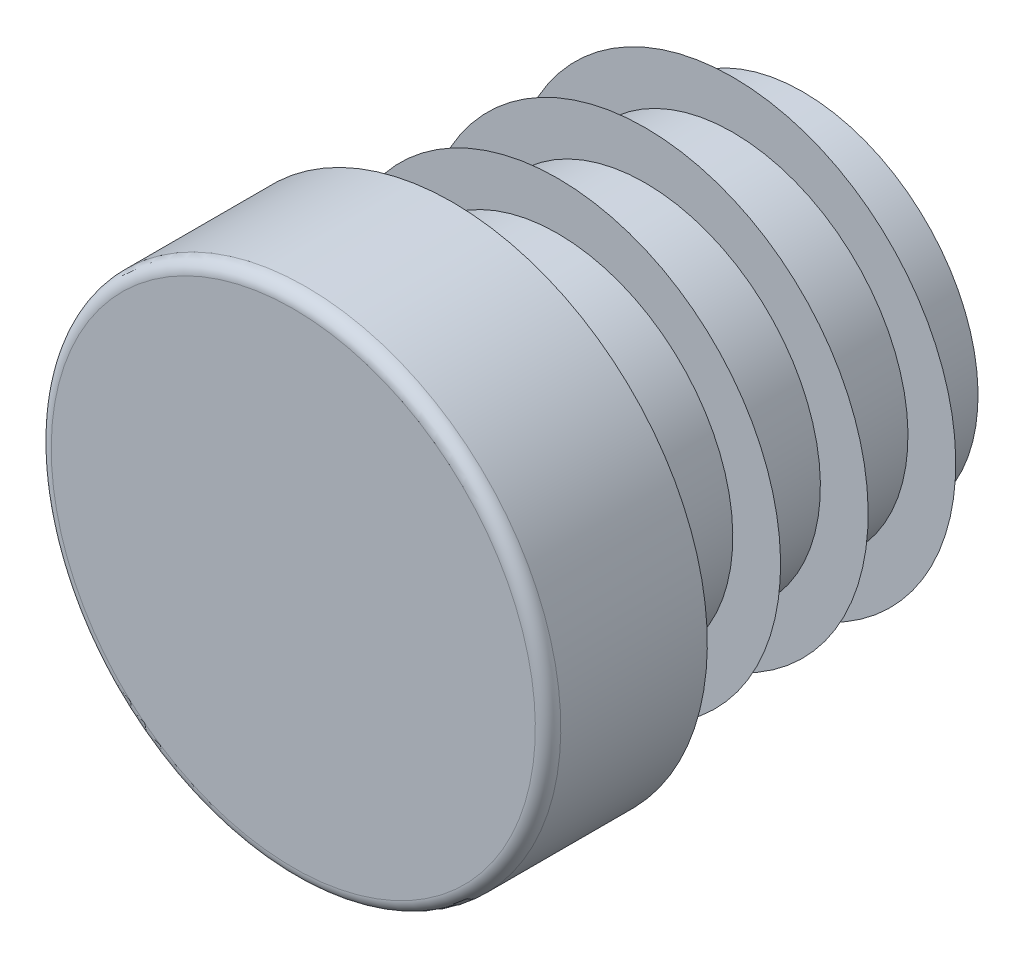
ISO-10303-21;
HEADER;
FILE_DESCRIPTION(('STEP AP214'),'2;1');
FILE_NAME('part.step','',(''),(''),'','','');
FILE_SCHEMA(('AUTOMOTIVE_DESIGN { 1 0 10303 214 1 1 1 1 }'));
ENDSEC;
DATA;
#1=APPLICATION_CONTEXT('core data for automotive mechanical design processes');
#2=APPLICATION_PROTOCOL_DEFINITION('international standard','automotive_design',2000,#1);
#3=PRODUCT_CONTEXT('',#1,'mechanical');
#4=PRODUCT('Part','Part','',(#3));
#5=PRODUCT_RELATED_PRODUCT_CATEGORY('part','',(#4));
#6=PRODUCT_DEFINITION_FORMATION('','',#4);
#7=PRODUCT_DEFINITION_CONTEXT('part definition',#1,'design');
#8=PRODUCT_DEFINITION('design','',#6,#7);
#9=PRODUCT_DEFINITION_SHAPE('','',#8);
#10=(LENGTH_UNIT() NAMED_UNIT(*) SI_UNIT(.MILLI.,.METRE.));
#11=(NAMED_UNIT(*) PLANE_ANGLE_UNIT() SI_UNIT($,.RADIAN.));
#12=(NAMED_UNIT(*) SI_UNIT($,.STERADIAN.) SOLID_ANGLE_UNIT());
#13=UNCERTAINTY_MEASURE_WITH_UNIT(LENGTH_MEASURE(1.E-05),#10,'distance_accuracy_value','');
#14=(GEOMETRIC_REPRESENTATION_CONTEXT(3) GLOBAL_UNCERTAINTY_ASSIGNED_CONTEXT((#13)) GLOBAL_UNIT_ASSIGNED_CONTEXT((#10,
#11,#12)) REPRESENTATION_CONTEXT('',''));
#15=CARTESIAN_POINT('',(0.,0.,0.));
#16=DIRECTION('',(0.,0.,1.));
#17=DIRECTION('',(1.,0.,0.));
#18=AXIS2_PLACEMENT_3D('',#15,#16,#17);
#19=CARTESIAN_POINT('',(0.,0.,5.));
#20=DIRECTION('',(0.,0.,-1.));
#21=DIRECTION('',(0.,1.,0.));
#22=AXIS2_PLACEMENT_3D('',#19,#20,#21);
#23=PLANE('',#22);
#24=CARTESIAN_POINT('',(0.,0.,5.));
#25=DIRECTION('',(0.,0.,-1.));
#26=DIRECTION('',(0.,1.,0.));
#27=AXIS2_PLACEMENT_3D('',#24,#25,#26);
#28=CIRCLE('',#27,7.6);
#29=CARTESIAN_POINT('',(0.,7.6,5.));
#30=VERTEX_POINT('',#29);
#31=EDGE_CURVE('E8',#30,#30,#28,.T.);
#32=ORIENTED_EDGE('',*,*,#31,.F.);
#33=EDGE_LOOP('',(#32));
#34=FACE_BOUND('',#33,.T.);
#35=ADVANCED_FACE('F12',(#34),#23,.F.);
#36=CARTESIAN_POINT('',(0.,0.,4.6));
#37=DIRECTION('',(0.,0.,-1.));
#38=DIRECTION('',(0.,1.,0.));
#39=AXIS2_PLACEMENT_3D('',#36,#37,#38);
#40=TOROIDAL_SURFACE('',#39,7.6,0.4);
#41=ORIENTED_EDGE('',*,*,#31,.T.);
#42=EDGE_LOOP('',(#41));
#43=FACE_BOUND('',#42,.T.);
#44=CARTESIAN_POINT('',(0.,0.,4.6));
#45=DIRECTION('',(0.,0.,-1.));
#46=DIRECTION('',(0.,1.,0.));
#47=AXIS2_PLACEMENT_3D('',#44,#45,#46);
#48=CIRCLE('',#47,8.);
#49=CARTESIAN_POINT('',(0.,8.,4.6));
#50=VERTEX_POINT('',#49);
#51=EDGE_CURVE('E18',#50,#50,#48,.T.);
#52=ORIENTED_EDGE('',*,*,#51,.F.);
#53=EDGE_LOOP('',(#52));
#54=FACE_BOUND('',#53,.T.);
#55=ADVANCED_FACE('F159',(#43,#54),#40,.T.);
#56=CARTESIAN_POINT('',(0.,0.,-11.));
#57=DIRECTION('',(0.,0.,-1.));
#58=DIRECTION('',(0.,1.,0.));
#59=AXIS2_PLACEMENT_3D('',#56,#57,#58);
#60=CYLINDRICAL_SURFACE('',#59,8.);
#61=CARTESIAN_POINT('',(0.,0.,0.));
#62=DIRECTION('',(0.,0.,-1.));
#63=DIRECTION('',(0.,1.,0.));
#64=AXIS2_PLACEMENT_3D('',#61,#62,#63);
#65=CIRCLE('',#64,8.);
#66=CARTESIAN_POINT('',(0.,8.,0.));
#67=VERTEX_POINT('',#66);
#68=EDGE_CURVE('E22',#67,#67,#65,.T.);
#69=ORIENTED_EDGE('',*,*,#68,.F.);
#70=EDGE_LOOP('',(#69));
#71=FACE_BOUND('',#70,.T.);
#72=ORIENTED_EDGE('',*,*,#51,.T.);
#73=EDGE_LOOP('',(#72));
#74=FACE_BOUND('',#73,.T.);
#75=ADVANCED_FACE('F154',(#71,#74),#60,.T.);
#76=CARTESIAN_POINT('',(8.,0.,0.));
#77=DIRECTION('',(0.,0.,1.));
#78=DIRECTION('',(0.,-1.,0.));
#79=AXIS2_PLACEMENT_3D('',#76,#77,#78);
#80=PLANE('',#79);
#81=CARTESIAN_POINT('',(0.,0.,0.));
#82=DIRECTION('',(0.,0.,-1.));
#83=DIRECTION('',(0.,1.,0.));
#84=AXIS2_PLACEMENT_3D('',#81,#82,#83);
#85=CIRCLE('',#84,5.5);
#86=CARTESIAN_POINT('',(0.,5.5,0.));
#87=VERTEX_POINT('',#86);
#88=EDGE_CURVE('E26',#87,#87,#85,.T.);
#89=ORIENTED_EDGE('',*,*,#88,.F.);
#90=EDGE_LOOP('',(#89));
#91=FACE_BOUND('',#90,.T.);
#92=ORIENTED_EDGE('',*,*,#68,.T.);
#93=EDGE_LOOP('',(#92));
#94=FACE_BOUND('',#93,.T.);
#95=ADVANCED_FACE('F148',(#91,#94),#80,.F.);
#96=CARTESIAN_POINT('',(0.,0.,-11.));
#97=DIRECTION('',(0.,0.,-1.));
#98=DIRECTION('',(0.,1.,0.));
#99=AXIS2_PLACEMENT_3D('',#96,#97,#98);
#100=CYLINDRICAL_SURFACE('',#99,5.5);
#101=CARTESIAN_POINT('',(0.,0.,-0.55));
#102=DIRECTION('',(0.,0.,-1.));
#103=DIRECTION('',(0.,1.,0.));
#104=AXIS2_PLACEMENT_3D('',#101,#102,#103);
#105=CIRCLE('',#104,5.5);
#106=CARTESIAN_POINT('',(0.,5.5,-0.55));
#107=VERTEX_POINT('',#106);
#108=EDGE_CURVE('E31',#107,#107,#105,.T.);
#109=ORIENTED_EDGE('',*,*,#108,.F.);
#110=EDGE_LOOP('',(#109));
#111=FACE_BOUND('',#110,.T.);
#112=ORIENTED_EDGE('',*,*,#88,.T.);
#113=EDGE_LOOP('',(#112));
#114=FACE_BOUND('',#113,.T.);
#115=ADVANCED_FACE('F142',(#111,#114),#100,.T.);
#116=CARTESIAN_POINT('',(5.5,0.,-0.55));
#117=DIRECTION('',(0.,0.,-1.));
#118=DIRECTION('',(0.,1.,0.));
#119=AXIS2_PLACEMENT_3D('',#116,#117,#118);
#120=PLANE('',#119);
#121=CARTESIAN_POINT('',(0.,0.,-0.55));
#122=DIRECTION('',(0.,0.,-1.));
#123=DIRECTION('',(0.,1.,0.));
#124=AXIS2_PLACEMENT_3D('',#121,#122,#123);
#125=CIRCLE('',#124,7.);
#126=CARTESIAN_POINT('',(0.,7.,-0.55));
#127=VERTEX_POINT('',#126);
#128=EDGE_CURVE('E34',#127,#127,#125,.T.);
#129=ORIENTED_EDGE('',*,*,#128,.F.);
#130=EDGE_LOOP('',(#129));
#131=FACE_BOUND('',#130,.T.);
#132=ORIENTED_EDGE('',*,*,#108,.T.);
#133=EDGE_LOOP('',(#132));
#134=FACE_BOUND('',#133,.T.);
#135=ADVANCED_FACE('F136',(#131,#134),#120,.F.);
#136=CARTESIAN_POINT('',(0.,0.,-0.55));
#137=DIRECTION('',(0.,0.,1.));
#138=DIRECTION('',(0.,-1.,0.));
#139=AXIS2_PLACEMENT_3D('',#136,#137,#138);
#140=CONICAL_SURFACE('',#139,7.,0.959931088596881);
#141=CARTESIAN_POINT('',(0.,0.,-1.60031130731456));
#142=DIRECTION('',(0.,0.,-1.));
#143=DIRECTION('',(0.,1.,0.));
#144=AXIS2_PLACEMENT_3D('',#141,#142,#143);
#145=CIRCLE('',#144,5.5);
#146=CARTESIAN_POINT('',(0.,5.5,-1.60031130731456));
#147=VERTEX_POINT('',#146);
#148=EDGE_CURVE('E37',#147,#147,#145,.T.);
#149=ORIENTED_EDGE('',*,*,#148,.F.);
#150=EDGE_LOOP('',(#149));
#151=FACE_BOUND('',#150,.T.);
#152=ORIENTED_EDGE('',*,*,#128,.T.);
#153=EDGE_LOOP('',(#152));
#154=FACE_BOUND('',#153,.T.);
#155=ADVANCED_FACE('F130',(#151,#154),#140,.T.);
#156=CARTESIAN_POINT('',(0.,0.,-11.));
#157=DIRECTION('',(0.,0.,-1.));
#158=DIRECTION('',(0.,1.,0.));
#159=AXIS2_PLACEMENT_3D('',#156,#157,#158);
#160=CYLINDRICAL_SURFACE('',#159,5.5);
#161=CARTESIAN_POINT('',(0.,0.,-3.3));
#162=DIRECTION('',(0.,0.,-1.));
#163=DIRECTION('',(0.,1.,0.));
#164=AXIS2_PLACEMENT_3D('',#161,#162,#163);
#165=CIRCLE('',#164,5.5);
#166=CARTESIAN_POINT('',(0.,5.5,-3.3));
#167=VERTEX_POINT('',#166);
#168=EDGE_CURVE('E40',#167,#167,#165,.T.);
#169=ORIENTED_EDGE('',*,*,#168,.F.);
#170=EDGE_LOOP('',(#169));
#171=FACE_BOUND('',#170,.T.);
#172=ORIENTED_EDGE('',*,*,#148,.T.);
#173=EDGE_LOOP('',(#172));
#174=FACE_BOUND('',#173,.T.);
#175=ADVANCED_FACE('F124',(#171,#174),#160,.T.);
#176=CARTESIAN_POINT('',(5.5,0.,-3.3));
#177=DIRECTION('',(0.,0.,-1.));
#178=DIRECTION('',(0.,1.,0.));
#179=AXIS2_PLACEMENT_3D('',#176,#177,#178);
#180=PLANE('',#179);
#181=CARTESIAN_POINT('',(0.,0.,-3.3));
#182=DIRECTION('',(0.,0.,-1.));
#183=DIRECTION('',(0.,1.,0.));
#184=AXIS2_PLACEMENT_3D('',#181,#182,#183);
#185=CIRCLE('',#184,7.);
#186=CARTESIAN_POINT('',(0.,7.,-3.3));
#187=VERTEX_POINT('',#186);
#188=EDGE_CURVE('E43',#187,#187,#185,.T.);
#189=ORIENTED_EDGE('',*,*,#188,.F.);
#190=EDGE_LOOP('',(#189));
#191=FACE_BOUND('',#190,.T.);
#192=ORIENTED_EDGE('',*,*,#168,.T.);
#193=EDGE_LOOP('',(#192));
#194=FACE_BOUND('',#193,.T.);
#195=ADVANCED_FACE('F118',(#191,#194),#180,.F.);
#196=CARTESIAN_POINT('',(0.,0.,-3.3));
#197=DIRECTION('',(0.,0.,1.));
#198=DIRECTION('',(0.,-1.,0.));
#199=AXIS2_PLACEMENT_3D('',#196,#197,#198);
#200=CONICAL_SURFACE('',#199,7.,0.959931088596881);
#201=CARTESIAN_POINT('',(0.,0.,-4.35031130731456));
#202=DIRECTION('',(0.,0.,-1.));
#203=DIRECTION('',(0.,1.,0.));
#204=AXIS2_PLACEMENT_3D('',#201,#202,#203);
#205=CIRCLE('',#204,5.5);
#206=CARTESIAN_POINT('',(0.,5.5,-4.35031130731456));
#207=VERTEX_POINT('',#206);
#208=EDGE_CURVE('E46',#207,#207,#205,.T.);
#209=ORIENTED_EDGE('',*,*,#208,.F.);
#210=EDGE_LOOP('',(#209));
#211=FACE_BOUND('',#210,.T.);
#212=ORIENTED_EDGE('',*,*,#188,.T.);
#213=EDGE_LOOP('',(#212));
#214=FACE_BOUND('',#213,.T.);
#215=ADVANCED_FACE('F112',(#211,#214),#200,.T.);
#216=CARTESIAN_POINT('',(0.,0.,-11.));
#217=DIRECTION('',(0.,0.,-1.));
#218=DIRECTION('',(0.,1.,0.));
#219=AXIS2_PLACEMENT_3D('',#216,#217,#218);
#220=CYLINDRICAL_SURFACE('',#219,5.5);
#221=CARTESIAN_POINT('',(0.,0.,-6.05));
#222=DIRECTION('',(0.,0.,-1.));
#223=DIRECTION('',(0.,1.,0.));
#224=AXIS2_PLACEMENT_3D('',#221,#222,#223);
#225=CIRCLE('',#224,5.5);
#226=CARTESIAN_POINT('',(0.,5.5,-6.05));
#227=VERTEX_POINT('',#226);
#228=EDGE_CURVE('E49',#227,#227,#225,.T.);
#229=ORIENTED_EDGE('',*,*,#228,.F.);
#230=EDGE_LOOP('',(#229));
#231=FACE_BOUND('',#230,.T.);
#232=ORIENTED_EDGE('',*,*,#208,.T.);
#233=EDGE_LOOP('',(#232));
#234=FACE_BOUND('',#233,.T.);
#235=ADVANCED_FACE('F106',(#231,#234),#220,.T.);
#236=CARTESIAN_POINT('',(5.5,0.,-6.05));
#237=DIRECTION('',(0.,0.,-1.));
#238=DIRECTION('',(0.,1.,0.));
#239=AXIS2_PLACEMENT_3D('',#236,#237,#238);
#240=PLANE('',#239);
#241=CARTESIAN_POINT('',(0.,0.,-6.05));
#242=DIRECTION('',(0.,0.,-1.));
#243=DIRECTION('',(0.,1.,0.));
#244=AXIS2_PLACEMENT_3D('',#241,#242,#243);
#245=CIRCLE('',#244,7.);
#246=CARTESIAN_POINT('',(0.,7.,-6.05));
#247=VERTEX_POINT('',#246);
#248=EDGE_CURVE('E52',#247,#247,#245,.T.);
#249=ORIENTED_EDGE('',*,*,#248,.F.);
#250=EDGE_LOOP('',(#249));
#251=FACE_BOUND('',#250,.T.);
#252=ORIENTED_EDGE('',*,*,#228,.T.);
#253=EDGE_LOOP('',(#252));
#254=FACE_BOUND('',#253,.T.);
#255=ADVANCED_FACE('F100',(#251,#254),#240,.F.);
#256=CARTESIAN_POINT('',(0.,0.,-6.05));
#257=DIRECTION('',(0.,0.,1.));
#258=DIRECTION('',(0.,-1.,0.));
#259=AXIS2_PLACEMENT_3D('',#256,#257,#258);
#260=CONICAL_SURFACE('',#259,7.,0.959931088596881);
#261=CARTESIAN_POINT('',(0.,0.,-7.10031130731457));
#262=DIRECTION('',(0.,0.,-1.));
#263=DIRECTION('',(0.,1.,0.));
#264=AXIS2_PLACEMENT_3D('',#261,#262,#263);
#265=CIRCLE('',#264,5.5);
#266=CARTESIAN_POINT('',(0.,5.5,-7.10031130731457));
#267=VERTEX_POINT('',#266);
#268=EDGE_CURVE('E55',#267,#267,#265,.T.);
#269=ORIENTED_EDGE('',*,*,#268,.F.);
#270=EDGE_LOOP('',(#269));
#271=FACE_BOUND('',#270,.T.);
#272=ORIENTED_EDGE('',*,*,#248,.T.);
#273=EDGE_LOOP('',(#272));
#274=FACE_BOUND('',#273,.T.);
#275=ADVANCED_FACE('F94',(#271,#274),#260,.T.);
#276=CARTESIAN_POINT('',(0.,0.,-11.));
#277=DIRECTION('',(0.,0.,-1.));
#278=DIRECTION('',(0.,1.,0.));
#279=AXIS2_PLACEMENT_3D('',#276,#277,#278);
#280=CYLINDRICAL_SURFACE('',#279,5.5);
#281=CARTESIAN_POINT('',(0.,0.,-8.8));
#282=DIRECTION('',(0.,0.,-1.));
#283=DIRECTION('',(0.,1.,0.));
#284=AXIS2_PLACEMENT_3D('',#281,#282,#283);
#285=CIRCLE('',#284,5.5);
#286=CARTESIAN_POINT('',(0.,5.5,-8.8));
#287=VERTEX_POINT('',#286);
#288=EDGE_CURVE('E58',#287,#287,#285,.T.);
#289=ORIENTED_EDGE('',*,*,#288,.F.);
#290=EDGE_LOOP('',(#289));
#291=FACE_BOUND('',#290,.T.);
#292=ORIENTED_EDGE('',*,*,#268,.T.);
#293=EDGE_LOOP('',(#292));
#294=FACE_BOUND('',#293,.T.);
#295=ADVANCED_FACE('F88',(#291,#294),#280,.T.);
#296=CARTESIAN_POINT('',(5.5,0.,-8.8));
#297=DIRECTION('',(0.,0.,-1.));
#298=DIRECTION('',(0.,1.,0.));
#299=AXIS2_PLACEMENT_3D('',#296,#297,#298);
#300=PLANE('',#299);
#301=CARTESIAN_POINT('',(0.,0.,-8.8));
#302=DIRECTION('',(0.,0.,-1.));
#303=DIRECTION('',(0.,1.,0.));
#304=AXIS2_PLACEMENT_3D('',#301,#302,#303);
#305=CIRCLE('',#304,7.);
#306=CARTESIAN_POINT('',(0.,7.,-8.8));
#307=VERTEX_POINT('',#306);
#308=EDGE_CURVE('E61',#307,#307,#305,.T.);
#309=ORIENTED_EDGE('',*,*,#308,.F.);
#310=EDGE_LOOP('',(#309));
#311=FACE_BOUND('',#310,.T.);
#312=ORIENTED_EDGE('',*,*,#288,.T.);
#313=EDGE_LOOP('',(#312));
#314=FACE_BOUND('',#313,.T.);
#315=ADVANCED_FACE('F82',(#311,#314),#300,.F.);
#316=CARTESIAN_POINT('',(0.,0.,-8.8));
#317=DIRECTION('',(0.,0.,1.));
#318=DIRECTION('',(0.,-1.,0.));
#319=AXIS2_PLACEMENT_3D('',#316,#317,#318);
#320=CONICAL_SURFACE('',#319,7.,0.959931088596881);
#321=CARTESIAN_POINT('',(0.,0.,-9.85031130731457));
#322=DIRECTION('',(0.,0.,-1.));
#323=DIRECTION('',(0.,1.,0.));
#324=AXIS2_PLACEMENT_3D('',#321,#322,#323);
#325=CIRCLE('',#324,5.5);
#326=CARTESIAN_POINT('',(0.,5.5,-9.85031130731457));
#327=VERTEX_POINT('',#326);
#328=EDGE_CURVE('E64',#327,#327,#325,.T.);
#329=ORIENTED_EDGE('',*,*,#328,.F.);
#330=EDGE_LOOP('',(#329));
#331=FACE_BOUND('',#330,.T.);
#332=ORIENTED_EDGE('',*,*,#308,.T.);
#333=EDGE_LOOP('',(#332));
#334=FACE_BOUND('',#333,.T.);
#335=ADVANCED_FACE('F76',(#331,#334),#320,.T.);
#336=CARTESIAN_POINT('',(0.,0.,-11.));
#337=DIRECTION('',(0.,0.,-1.));
#338=DIRECTION('',(0.,1.,0.));
#339=AXIS2_PLACEMENT_3D('',#336,#337,#338);
#340=CYLINDRICAL_SURFACE('',#339,5.5);
#341=CARTESIAN_POINT('',(0.,0.,-11.));
#342=DIRECTION('',(0.,0.,-1.));
#343=DIRECTION('',(0.,1.,0.));
#344=AXIS2_PLACEMENT_3D('',#341,#342,#343);
#345=CIRCLE('',#344,5.5);
#346=CARTESIAN_POINT('',(0.,5.5,-11.));
#347=VERTEX_POINT('',#346);
#348=EDGE_CURVE('E67',#347,#347,#345,.T.);
#349=ORIENTED_EDGE('',*,*,#348,.F.);
#350=EDGE_LOOP('',(#349));
#351=FACE_BOUND('',#350,.T.);
#352=ORIENTED_EDGE('',*,*,#328,.T.);
#353=EDGE_LOOP('',(#352));
#354=FACE_BOUND('',#353,.T.);
#355=ADVANCED_FACE('F73',(#351,#354),#340,.T.);
#356=CARTESIAN_POINT('',(5.5,0.,-11.));
#357=DIRECTION('',(0.,0.,1.));
#358=DIRECTION('',(0.,-1.,0.));
#359=AXIS2_PLACEMENT_3D('',#356,#357,#358);
#360=PLANE('',#359);
#361=ORIENTED_EDGE('',*,*,#348,.T.);
#362=EDGE_LOOP('',(#361));
#363=FACE_BOUND('',#362,.T.);
#364=ADVANCED_FACE('F71',(#363),#360,.F.);
#365=CLOSED_SHELL('',(#35,#55,#75,#95,#115,#135,#155,#175,#195,#215,#235,#255,#275,#295,#315,
#335,#355,#364));
#366=MANIFOLD_SOLID_BREP('B1',#365);
#367=ADVANCED_BREP_SHAPE_REPRESENTATION('',(#18,#366),#14);
#368=SHAPE_DEFINITION_REPRESENTATION(#9,#367);
ENDSEC;
END-ISO-10303-21;
